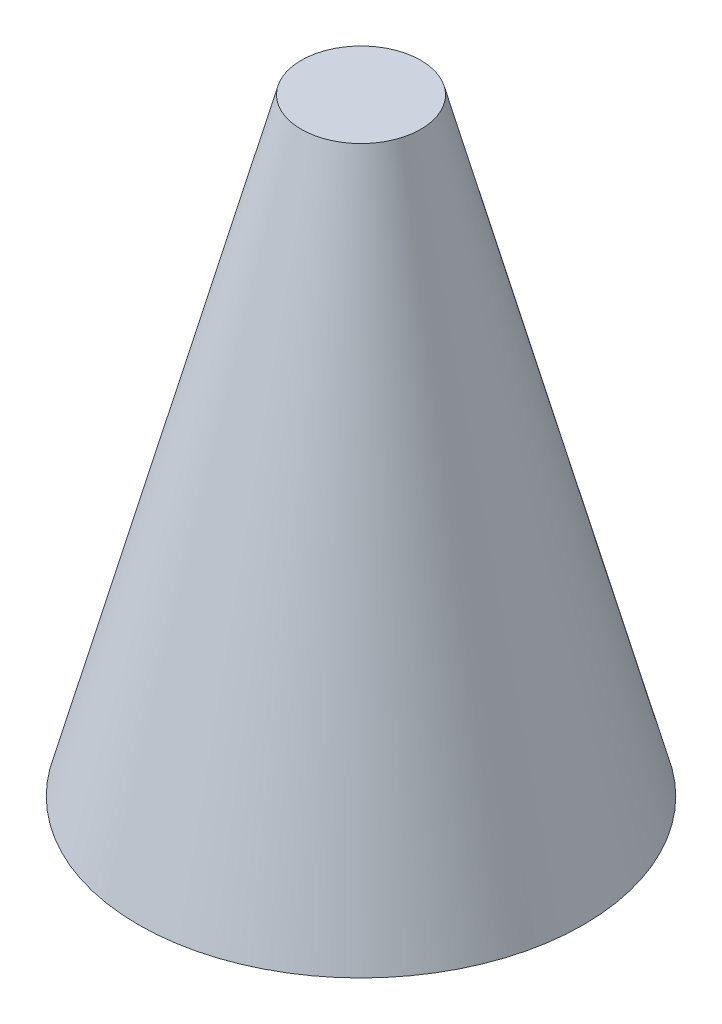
ISO-10303-21;
HEADER;
FILE_DESCRIPTION(('STEP AP214'),'2;1');
FILE_NAME('part.step','',(''),(''),'','','');
FILE_SCHEMA(('AUTOMOTIVE_DESIGN { 1 0 10303 214 1 1 1 1 }'));
ENDSEC;
DATA;
#1=APPLICATION_CONTEXT('core data for automotive mechanical design processes');
#2=APPLICATION_PROTOCOL_DEFINITION('international standard','automotive_design',2000,#1);
#3=PRODUCT_CONTEXT('',#1,'mechanical');
#4=PRODUCT('Part','Part','',(#3));
#5=PRODUCT_RELATED_PRODUCT_CATEGORY('part','',(#4));
#6=PRODUCT_DEFINITION_FORMATION('','',#4);
#7=PRODUCT_DEFINITION_CONTEXT('part definition',#1,'design');
#8=PRODUCT_DEFINITION('design','',#6,#7);
#9=PRODUCT_DEFINITION_SHAPE('','',#8);
#10=(LENGTH_UNIT() NAMED_UNIT(*) SI_UNIT(.MILLI.,.METRE.));
#11=(NAMED_UNIT(*) PLANE_ANGLE_UNIT() SI_UNIT($,.RADIAN.));
#12=(NAMED_UNIT(*) SI_UNIT($,.STERADIAN.) SOLID_ANGLE_UNIT());
#13=UNCERTAINTY_MEASURE_WITH_UNIT(LENGTH_MEASURE(1.E-05),#10,'distance_accuracy_value','');
#14=(GEOMETRIC_REPRESENTATION_CONTEXT(3) GLOBAL_UNCERTAINTY_ASSIGNED_CONTEXT((#13)) GLOBAL_UNIT_ASSIGNED_CONTEXT((#10,
#11,#12)) REPRESENTATION_CONTEXT('',''));
#15=CARTESIAN_POINT('',(0.,0.,0.));
#16=DIRECTION('',(0.,0.,1.));
#17=DIRECTION('',(1.,0.,0.));
#18=AXIS2_PLACEMENT_3D('',#15,#16,#17);
#19=CARTESIAN_POINT('',(-139.588642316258,-381.,0.));
#20=DIRECTION('',(0.,1.,0.));
#21=DIRECTION('',(0.,0.,1.));
#22=AXIS2_PLACEMENT_3D('',#19,#20,#21);
#23=PLANE('',#22);
#24=CARTESIAN_POINT('',(0.,-381.,0.));
#25=DIRECTION('',(0.,1.,0.));
#26=DIRECTION('',(-1.,0.,0.));
#27=AXIS2_PLACEMENT_3D('',#24,#25,#26);
#28=CIRCLE('',#27,63.3886423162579);
#29=CARTESIAN_POINT('',(-63.3886423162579,-381.,0.));
#30=VERTEX_POINT('',#29);
#31=EDGE_CURVE('E63',#30,#30,#28,.T.);
#32=ORIENTED_EDGE('',*,*,#31,.T.);
#33=EDGE_LOOP('',(#32));
#34=FACE_BOUND('',#33,.T.);
#35=CARTESIAN_POINT('',(0.,-381.,0.));
#36=DIRECTION('',(0.,-1.,0.));
#37=DIRECTION('',(0.,0.,-1.));
#38=AXIS2_PLACEMENT_3D('',#35,#36,#37);
#39=CIRCLE('',#38,139.588642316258);
#40=CARTESIAN_POINT('',(0.,-381.,-139.588642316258));
#41=VERTEX_POINT('',#40);
#42=EDGE_CURVE('E40',#41,#41,#39,.T.);
#43=ORIENTED_EDGE('',*,*,#42,.T.);
#44=EDGE_LOOP('',(#43));
#45=FACE_BOUND('',#44,.T.);
#46=ADVANCED_FACE('F34',(#34,#45),#23,.F.);
#47=CARTESIAN_POINT('',(0.,0.,0.));
#48=DIRECTION('',(0.,-1.,0.));
#49=DIRECTION('',(0.,0.,-1.));
#50=AXIS2_PLACEMENT_3D('',#47,#48,#49);
#51=PLANE('',#50);
#52=CARTESIAN_POINT('',(0.,0.,0.));
#53=DIRECTION('',(0.,-1.,0.));
#54=DIRECTION('',(0.,0.,-1.));
#55=AXIS2_PLACEMENT_3D('',#52,#53,#54);
#56=CIRCLE('',#55,37.5);
#57=CARTESIAN_POINT('',(0.,0.,-37.5));
#58=VERTEX_POINT('',#57);
#59=EDGE_CURVE('E11',#58,#58,#56,.T.);
#60=ORIENTED_EDGE('',*,*,#59,.F.);
#61=EDGE_LOOP('',(#60));
#62=FACE_BOUND('',#61,.T.);
#63=ADVANCED_FACE('F51',(#62),#51,.F.);
#64=CARTESIAN_POINT('',(0.,0.,0.));
#65=DIRECTION('',(0.,-1.,0.));
#66=DIRECTION('',(0.,0.,-1.));
#67=AXIS2_PLACEMENT_3D('',#64,#65,#66);
#68=CONICAL_SURFACE('',#67,37.5,0.26179938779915);
#69=CARTESIAN_POINT('',(0.,-381.,-139.588642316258));
#70=CARTESIAN_POINT('',(0.,-377.03125,-138.525218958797));
#71=CARTESIAN_POINT('',(0.,-373.0625,-137.461795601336));
#72=CARTESIAN_POINT('',(0.,-365.125,-135.334948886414));
#73=CARTESIAN_POINT('',(0.,-361.15625,-134.271525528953));
#74=CARTESIAN_POINT('',(0.,-353.21875,-132.144678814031));
#75=CARTESIAN_POINT('',(0.,-349.25,-131.08125545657));
#76=CARTESIAN_POINT('',(0.,-341.3125,-128.954408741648));
#77=CARTESIAN_POINT('',(0.,-337.34375,-127.890985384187));
#78=CARTESIAN_POINT('',(0.,-329.40625,-125.764138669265));
#79=CARTESIAN_POINT('',(0.,-325.4375,-124.700715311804));
#80=CARTESIAN_POINT('',(0.,-317.5,-122.573868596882));
#81=CARTESIAN_POINT('',(0.,-313.53125,-121.510445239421));
#82=CARTESIAN_POINT('',(0.,-305.59375,-119.383598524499));
#83=CARTESIAN_POINT('',(0.,-301.625,-118.320175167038));
#84=CARTESIAN_POINT('',(0.,-293.6875,-116.193328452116));
#85=CARTESIAN_POINT('',(0.,-289.71875,-115.129905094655));
#86=CARTESIAN_POINT('',(0.,-281.78125,-113.003058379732));
#87=CARTESIAN_POINT('',(0.,-277.8125,-111.939635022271));
#88=CARTESIAN_POINT('',(0.,-269.875,-109.812788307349));
#89=CARTESIAN_POINT('',(0.,-265.90625,-108.749364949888));
#90=CARTESIAN_POINT('',(0.,-257.96875,-106.622518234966));
#91=CARTESIAN_POINT('',(0.,-254.,-105.559094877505));
#92=CARTESIAN_POINT('',(0.,-246.0625,-103.432248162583));
#93=CARTESIAN_POINT('',(0.,-242.09375,-102.368824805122));
#94=CARTESIAN_POINT('',(0.,-234.15625,-100.2419780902));
#95=CARTESIAN_POINT('',(0.,-230.1875,-99.1785547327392));
#96=CARTESIAN_POINT('',(0.,-222.25,-97.0517080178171));
#97=CARTESIAN_POINT('',(0.,-218.28125,-95.9882846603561));
#98=CARTESIAN_POINT('',(0.,-210.34375,-93.8614379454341));
#99=CARTESIAN_POINT('',(0.,-206.375,-92.7980145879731));
#100=CARTESIAN_POINT('',(0.,-198.4375,-90.671167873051));
#101=CARTESIAN_POINT('',(0.,-194.46875,-89.60774451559));
#102=CARTESIAN_POINT('',(0.,-186.53125,-87.4808978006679));
#103=CARTESIAN_POINT('',(0.,-182.5625,-86.4174744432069));
#104=CARTESIAN_POINT('',(0.,-174.625,-84.2906277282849));
#105=CARTESIAN_POINT('',(0.,-170.65625,-83.2272043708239));
#106=CARTESIAN_POINT('',(0.,-162.71875,-81.1003576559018));
#107=CARTESIAN_POINT('',(0.,-158.75,-80.0369342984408));
#108=CARTESIAN_POINT('',(0.,-150.8125,-77.9100875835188));
#109=CARTESIAN_POINT('',(0.,-146.84375,-76.8466642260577));
#110=CARTESIAN_POINT('',(0.,-138.90625,-74.7198175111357));
#111=CARTESIAN_POINT('',(0.,-134.9375,-73.6563941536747));
#112=CARTESIAN_POINT('',(0.,-127.,-71.5295474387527));
#113=CARTESIAN_POINT('',(0.,-123.03125,-70.4661240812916));
#114=CARTESIAN_POINT('',(0.,-115.09375,-68.3392773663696));
#115=CARTESIAN_POINT('',(0.,-111.125,-67.2758540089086));
#116=CARTESIAN_POINT('',(0.,-103.1875,-65.1490072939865));
#117=CARTESIAN_POINT('',(0.,-99.21875,-64.0855839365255));
#118=CARTESIAN_POINT('',(0.,-91.28125,-61.9587372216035));
#119=CARTESIAN_POINT('',(0.,-87.3125,-60.8953138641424));
#120=CARTESIAN_POINT('',(0.,-79.375,-58.7684671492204));
#121=CARTESIAN_POINT('',(0.,-75.40625,-57.7050437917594));
#122=CARTESIAN_POINT('',(0.,-67.46875,-55.5781970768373));
#123=CARTESIAN_POINT('',(0.,-63.5,-54.5147737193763));
#124=CARTESIAN_POINT('',(0.,-55.5625,-52.3879270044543));
#125=CARTESIAN_POINT('',(0.,-51.59375,-51.3245036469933));
#126=CARTESIAN_POINT('',(0.,-43.65625,-49.1976569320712));
#127=CARTESIAN_POINT('',(0.,-39.6875,-48.1342335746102));
#128=CARTESIAN_POINT('',(0.,-31.75,-46.0073868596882));
#129=CARTESIAN_POINT('',(0.,-27.78125,-44.9439635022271));
#130=CARTESIAN_POINT('',(0.,-19.84375,-42.8171167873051));
#131=CARTESIAN_POINT('',(0.,-15.875,-41.7536934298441));
#132=CARTESIAN_POINT('',(0.,-7.93750000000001,-39.626846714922));
#133=CARTESIAN_POINT('',(0.,-3.96875,-38.563423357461));
#134=CARTESIAN_POINT('',(0.,0.,-37.5));
#135=B_SPLINE_CURVE_WITH_KNOTS('',3,(#69,#70,#71,#72,#73,#74,#75,#76,#77,#78,#79,#80,#81,#82,
#83,#84,#85,#86,#87,#88,#89,#90,#91,#92,#93,#94,#95,#96,#97,#98,#99,#100,#101,#102,#103,#104,
#105,#106,#107,#108,#109,#110,#111,#112,#113,#114,#115,#116,#117,#118,#119,#120,#121,#122,#123,
#124,#125,#126,#127,#128,#129,#130,#131,#132,#133,#134),.UNSPECIFIED.,.F.,.F.,(4,2,2,2,2,2,2,2,
2,2,2,2,2,2,2,2,2,2,2,2,2,2,2,2,2,2,2,2,2,2,2,2,4),(0.,12.3262570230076,24.6525140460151,
36.9787710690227,49.3050280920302,61.6312851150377,73.9575421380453,86.2837991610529,
98.6100561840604,110.936313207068,123.262570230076,135.588827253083,147.915084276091,
160.241341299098,172.567598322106,184.893855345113,197.220112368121,209.546369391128,
221.872626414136,234.198883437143,246.525140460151,258.851397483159,271.177654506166,
283.503911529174,295.830168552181,308.156425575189,320.482682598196,332.808939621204,
345.135196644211,357.461453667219,369.787710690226,382.113967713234,394.440224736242),.UNSPECIFIED.);
#136=EDGE_CURVE('BSEAM45',#41,#58,#135,.T.);
#137=ORIENTED_EDGE('',*,*,#42,.F.);
#138=ORIENTED_EDGE('',*,*,#59,.T.);
#139=ORIENTED_EDGE('',*,*,#136,.T.);
#140=ORIENTED_EDGE('',*,*,#136,.F.);
#141=EDGE_LOOP('',(#137,#139,#138,#140));
#142=FACE_BOUND('',#141,.T.);
#143=ADVANCED_FACE('F45',(#142),#68,.T.);
#144=CARTESIAN_POINT('',(-1.11022302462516E-13,-65.3081795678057,0.));
#145=DIRECTION('',(0.,-1.,0.));
#146=DIRECTION('',(1.,0.,0.));
#147=AXIS2_PLACEMENT_3D('',#144,#145,#146);
#148=CONICAL_SURFACE('',#147,0.,0.198157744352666);
#149=ORIENTED_EDGE('',*,*,#31,.F.);
#150=EDGE_LOOP('',(#149));
#151=FACE_BOUND('',#150,.T.);
#152=CARTESIAN_POINT('',(-1.11022302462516E-13,-65.3081795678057,0.));
#153=VERTEX_POINT('',#152);
#154=VERTEX_LOOP('',#153);
#155=FACE_BOUND('',#154,.T.);
#156=ADVANCED_FACE('F43',(#151,#155),#148,.F.);
#157=CLOSED_SHELL('',(#46,#63,#143,#156));
#158=MANIFOLD_SOLID_BREP('B2',#157);
#159=ADVANCED_BREP_SHAPE_REPRESENTATION('',(#18,#158),#14);
#160=SHAPE_DEFINITION_REPRESENTATION(#9,#159);
ENDSEC;
END-ISO-10303-21;
